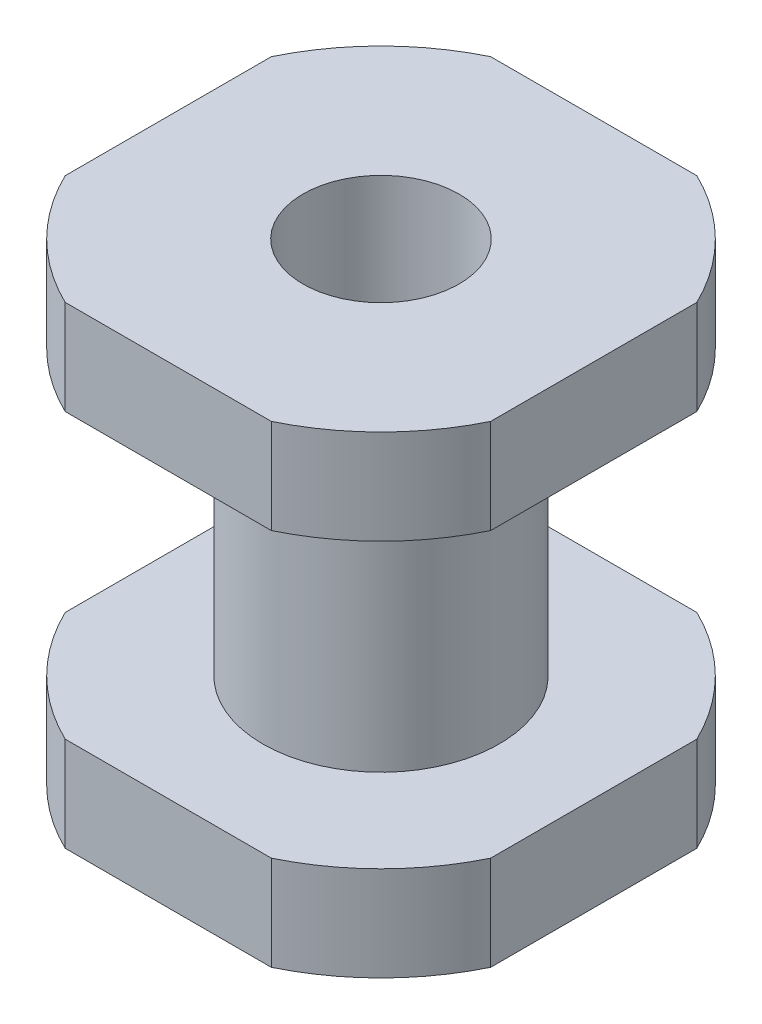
ISO-10303-21;
HEADER;
FILE_DESCRIPTION(('STEP AP214'),'2;1');
FILE_NAME('part.step','',(''),(''),'','','');
FILE_SCHEMA(('AUTOMOTIVE_DESIGN { 1 0 10303 214 1 1 1 1 }'));
ENDSEC;
DATA;
#1=APPLICATION_CONTEXT('core data for automotive mechanical design processes');
#2=APPLICATION_PROTOCOL_DEFINITION('international standard','automotive_design',2000,#1);
#3=PRODUCT_CONTEXT('',#1,'mechanical');
#4=PRODUCT('Part','Part','',(#3));
#5=PRODUCT_RELATED_PRODUCT_CATEGORY('part','',(#4));
#6=PRODUCT_DEFINITION_FORMATION('','',#4);
#7=PRODUCT_DEFINITION_CONTEXT('part definition',#1,'design');
#8=PRODUCT_DEFINITION('design','',#6,#7);
#9=PRODUCT_DEFINITION_SHAPE('','',#8);
#10=(LENGTH_UNIT() NAMED_UNIT(*) SI_UNIT(.MILLI.,.METRE.));
#11=(NAMED_UNIT(*) PLANE_ANGLE_UNIT() SI_UNIT($,.RADIAN.));
#12=(NAMED_UNIT(*) SI_UNIT($,.STERADIAN.) SOLID_ANGLE_UNIT());
#13=UNCERTAINTY_MEASURE_WITH_UNIT(LENGTH_MEASURE(1.E-05),#10,'distance_accuracy_value','');
#14=(GEOMETRIC_REPRESENTATION_CONTEXT(3) GLOBAL_UNCERTAINTY_ASSIGNED_CONTEXT((#13)) GLOBAL_UNIT_ASSIGNED_CONTEXT((#10,
#11,#12)) REPRESENTATION_CONTEXT('',''));
#15=CARTESIAN_POINT('',(0.,0.,0.));
#16=DIRECTION('',(0.,0.,1.));
#17=DIRECTION('',(1.,0.,0.));
#18=AXIS2_PLACEMENT_3D('',#15,#16,#17);
#19=CARTESIAN_POINT('',(-11.3777969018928,1.18499139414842,0.));
#20=DIRECTION('',(0.,-1.,0.));
#21=DIRECTION('',(0.,0.,-1.));
#22=AXIS2_PLACEMENT_3D('',#19,#20,#21);
#23=PLANE('',#22);
#24=CARTESIAN_POINT('',(-11.3777969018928,1.18499139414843,0.));
#25=DIRECTION('',(0.,-1.,0.));
#26=DIRECTION('',(0.,0.,-1.));
#27=AXIS2_PLACEMENT_3D('',#24,#25,#26);
#28=CIRCLE('',#27,1.65);
#29=CARTESIAN_POINT('',(-11.3777969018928,1.18499139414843,-1.65));
#30=VERTEX_POINT('',#29);
#31=EDGE_CURVE('E246',#30,#30,#28,.T.);
#32=ORIENTED_EDGE('',*,*,#31,.T.);
#33=EDGE_LOOP('',(#32));
#34=FACE_BOUND('',#33,.T.);
#35=DIRECTION('',(0.,0.,-1.));
#36=VECTOR('',#35,1.);
#37=CARTESIAN_POINT('',(-6.87779690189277,1.18499139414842,-4.5));
#38=LINE('',#37,#36);
#39=CARTESIAN_POINT('',(-6.87779690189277,1.18499139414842,2.17944947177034));
#40=VERTEX_POINT('',#39);
#41=CARTESIAN_POINT('',(-6.87779690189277,1.18499139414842,-2.17944947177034));
#42=VERTEX_POINT('',#41);
#43=EDGE_CURVE('E138',#40,#42,#38,.T.);
#44=ORIENTED_EDGE('',*,*,#43,.T.);
#45=CARTESIAN_POINT('',(-11.3777969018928,1.18499139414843,0.));
#46=DIRECTION('',(0.,1.,0.));
#47=DIRECTION('',(0.,0.,1.));
#48=AXIS2_PLACEMENT_3D('',#45,#46,#47);
#49=CIRCLE('',#48,5.);
#50=CARTESIAN_POINT('',(-9.19834743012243,1.18499139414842,-4.5));
#51=VERTEX_POINT('',#50);
#52=EDGE_CURVE('E145',#42,#51,#49,.T.);
#53=ORIENTED_EDGE('',*,*,#52,.T.);
#54=DIRECTION('',(-1.,0.,0.));
#55=VECTOR('',#54,1.);
#56=CARTESIAN_POINT('',(-15.8777969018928,1.18499139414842,-4.5));
#57=LINE('',#56,#55);
#58=CARTESIAN_POINT('',(-13.5572463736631,1.18499139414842,-4.5));
#59=VERTEX_POINT('',#58);
#60=EDGE_CURVE('E126',#51,#59,#57,.T.);
#61=ORIENTED_EDGE('',*,*,#60,.T.);
#62=CARTESIAN_POINT('',(-15.8777969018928,1.18499139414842,-2.17944947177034));
#63=VERTEX_POINT('',#62);
#64=EDGE_CURVE('E153',#59,#63,#49,.T.);
#65=ORIENTED_EDGE('',*,*,#64,.T.);
#66=DIRECTION('',(0.,0.,1.));
#67=VECTOR('',#66,1.);
#68=CARTESIAN_POINT('',(-15.8777969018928,1.18499139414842,-4.5));
#69=LINE('',#68,#67);
#70=CARTESIAN_POINT('',(-15.8777969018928,1.18499139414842,2.17944947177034));
#71=VERTEX_POINT('',#70);
#72=EDGE_CURVE('E137',#63,#71,#69,.T.);
#73=ORIENTED_EDGE('',*,*,#72,.T.);
#74=CARTESIAN_POINT('',(-13.5572463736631,1.18499139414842,4.5));
#75=VERTEX_POINT('',#74);
#76=EDGE_CURVE('E156',#71,#75,#49,.T.);
#77=ORIENTED_EDGE('',*,*,#76,.T.);
#78=DIRECTION('',(1.,0.,0.));
#79=VECTOR('',#78,1.);
#80=CARTESIAN_POINT('',(-15.8777969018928,1.18499139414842,4.5));
#81=LINE('',#80,#79);
#82=CARTESIAN_POINT('',(-9.19834743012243,1.18499139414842,4.5));
#83=VERTEX_POINT('',#82);
#84=EDGE_CURVE('E240',#75,#83,#81,.T.);
#85=ORIENTED_EDGE('',*,*,#84,.T.);
#86=EDGE_CURVE('E152',#83,#40,#49,.T.);
#87=ORIENTED_EDGE('',*,*,#86,.T.);
#88=EDGE_LOOP('',(#44,#53,#61,#65,#73,#77,#85,#87));
#89=FACE_BOUND('',#88,.T.);
#90=ADVANCED_FACE('F16',(#34,#89),#23,.F.);
#91=CARTESIAN_POINT('',(-11.3777969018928,4.31752151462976,0.));
#92=DIRECTION('',(0.,1.,0.));
#93=DIRECTION('',(0.,0.,1.));
#94=AXIS2_PLACEMENT_3D('',#91,#92,#93);
#95=CYLINDRICAL_SURFACE('',#94,5.);
#96=DIRECTION('',(0.,1.,0.));
#97=VECTOR('',#96,1.);
#98=CARTESIAN_POINT('',(-6.87779690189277,4.31752151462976,-2.17944947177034));
#99=LINE('',#98,#97);
#100=CARTESIAN_POINT('',(-6.87779690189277,-0.815008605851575,-2.17944947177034));
#101=VERTEX_POINT('',#100);
#102=EDGE_CURVE('E199',#101,#42,#99,.T.);
#103=ORIENTED_EDGE('',*,*,#102,.F.);
#104=CARTESIAN_POINT('',(-11.3777969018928,-0.815008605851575,0.));
#105=DIRECTION('',(0.,1.,0.));
#106=DIRECTION('',(0.,0.,1.));
#107=AXIS2_PLACEMENT_3D('',#104,#105,#106);
#108=CIRCLE('',#107,5.);
#109=CARTESIAN_POINT('',(-9.19834743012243,-0.815008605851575,-4.5));
#110=VERTEX_POINT('',#109);
#111=EDGE_CURVE('E147',#101,#110,#108,.T.);
#112=ORIENTED_EDGE('',*,*,#111,.T.);
#113=DIRECTION('',(0.,1.,0.));
#114=VECTOR('',#113,1.);
#115=CARTESIAN_POINT('',(-9.19834743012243,4.31752151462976,-4.5));
#116=LINE('',#115,#114);
#117=EDGE_CURVE('E129',#51,#110,#116,.F.);
#118=ORIENTED_EDGE('',*,*,#117,.F.);
#119=ORIENTED_EDGE('',*,*,#52,.F.);
#120=EDGE_LOOP('',(#103,#112,#118,#119));
#121=FACE_BOUND('',#120,.T.);
#122=ADVANCED_FACE('F144',(#121),#95,.T.);
#123=DIRECTION('',(0.,1.,0.));
#124=VECTOR('',#123,1.);
#125=CARTESIAN_POINT('',(-6.87779690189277,4.31752151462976,2.17944947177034));
#126=LINE('',#125,#124);
#127=CARTESIAN_POINT('',(-6.87779690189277,-0.815008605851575,2.17944947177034));
#128=VERTEX_POINT('',#127);
#129=EDGE_CURVE('E203',#40,#128,#126,.F.);
#130=ORIENTED_EDGE('',*,*,#129,.F.);
#131=ORIENTED_EDGE('',*,*,#86,.F.);
#132=DIRECTION('',(0.,1.,0.));
#133=VECTOR('',#132,1.);
#134=CARTESIAN_POINT('',(-9.19834743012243,4.31752151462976,4.5));
#135=LINE('',#134,#133);
#136=CARTESIAN_POINT('',(-9.19834743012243,-0.815008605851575,4.5));
#137=VERTEX_POINT('',#136);
#138=EDGE_CURVE('E215',#137,#83,#135,.T.);
#139=ORIENTED_EDGE('',*,*,#138,.F.);
#140=EDGE_CURVE('E159',#137,#128,#108,.T.);
#141=ORIENTED_EDGE('',*,*,#140,.T.);
#142=EDGE_LOOP('',(#130,#131,#139,#141));
#143=FACE_BOUND('',#142,.T.);
#144=ADVANCED_FACE('F279',(#143),#95,.T.);
#145=DIRECTION('',(0.,1.,0.));
#146=VECTOR('',#145,1.);
#147=CARTESIAN_POINT('',(-13.5572463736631,4.31752151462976,4.5));
#148=LINE('',#147,#146);
#149=CARTESIAN_POINT('',(-13.5572463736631,-0.815008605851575,4.5));
#150=VERTEX_POINT('',#149);
#151=EDGE_CURVE('E30',#75,#150,#148,.F.);
#152=ORIENTED_EDGE('',*,*,#151,.F.);
#153=ORIENTED_EDGE('',*,*,#76,.F.);
#154=DIRECTION('',(0.,1.,0.));
#155=VECTOR('',#154,1.);
#156=CARTESIAN_POINT('',(-15.8777969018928,4.31752151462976,2.17944947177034));
#157=LINE('',#156,#155);
#158=CARTESIAN_POINT('',(-15.8777969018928,-0.815008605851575,2.17944947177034));
#159=VERTEX_POINT('',#158);
#160=EDGE_CURVE('E221',#159,#71,#157,.T.);
#161=ORIENTED_EDGE('',*,*,#160,.F.);
#162=EDGE_CURVE('E332',#159,#150,#108,.T.);
#163=ORIENTED_EDGE('',*,*,#162,.T.);
#164=EDGE_LOOP('',(#152,#153,#161,#163));
#165=FACE_BOUND('',#164,.T.);
#166=ADVANCED_FACE('F349',(#165),#95,.T.);
#167=DIRECTION('',(0.,1.,0.));
#168=VECTOR('',#167,1.);
#169=CARTESIAN_POINT('',(-15.8777969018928,4.31752151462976,-2.17944947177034));
#170=LINE('',#169,#168);
#171=CARTESIAN_POINT('',(-15.8777969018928,-0.815008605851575,-2.17944947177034));
#172=VERTEX_POINT('',#171);
#173=EDGE_CURVE('E38',#63,#172,#170,.F.);
#174=ORIENTED_EDGE('',*,*,#173,.F.);
#175=ORIENTED_EDGE('',*,*,#64,.F.);
#176=DIRECTION('',(0.,1.,0.));
#177=VECTOR('',#176,1.);
#178=CARTESIAN_POINT('',(-13.5572463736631,4.31752151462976,-4.5));
#179=LINE('',#178,#177);
#180=CARTESIAN_POINT('',(-13.5572463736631,-0.815008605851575,-4.5));
#181=VERTEX_POINT('',#180);
#182=EDGE_CURVE('E132',#181,#59,#179,.T.);
#183=ORIENTED_EDGE('',*,*,#182,.F.);
#184=EDGE_CURVE('E336',#181,#172,#108,.T.);
#185=ORIENTED_EDGE('',*,*,#184,.T.);
#186=EDGE_LOOP('',(#174,#175,#183,#185));
#187=FACE_BOUND('',#186,.T.);
#188=ADVANCED_FACE('F280',(#187),#95,.T.);
#189=CARTESIAN_POINT('',(-6.37779690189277,-0.815008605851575,0.));
#190=DIRECTION('',(0.,1.,0.));
#191=DIRECTION('',(0.,0.,1.));
#192=AXIS2_PLACEMENT_3D('',#189,#190,#191);
#193=PLANE('',#192);
#194=CARTESIAN_POINT('',(-11.3777969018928,-0.815008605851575,0.));
#195=DIRECTION('',(0.,1.,0.));
#196=DIRECTION('',(0.,0.,1.));
#197=AXIS2_PLACEMENT_3D('',#194,#195,#196);
#198=CIRCLE('',#197,2.5);
#199=CARTESIAN_POINT('',(-11.3777969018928,-0.815008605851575,2.5));
#200=VERTEX_POINT('',#199);
#201=EDGE_CURVE('E330',#200,#200,#198,.T.);
#202=ORIENTED_EDGE('',*,*,#201,.T.);
#203=EDGE_LOOP('',(#202));
#204=FACE_BOUND('',#203,.T.);
#205=DIRECTION('',(0.,0.,-1.));
#206=VECTOR('',#205,1.);
#207=CARTESIAN_POINT('',(-6.87779690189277,-0.815008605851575,0.));
#208=LINE('',#207,#206);
#209=EDGE_CURVE('E205',#128,#101,#208,.T.);
#210=ORIENTED_EDGE('',*,*,#209,.F.);
#211=ORIENTED_EDGE('',*,*,#140,.F.);
#212=DIRECTION('',(1.,0.,0.));
#213=VECTOR('',#212,1.);
#214=CARTESIAN_POINT('',(-6.37779690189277,-0.815008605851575,4.5));
#215=LINE('',#214,#213);
#216=EDGE_CURVE('E183',#150,#137,#215,.T.);
#217=ORIENTED_EDGE('',*,*,#216,.F.);
#218=ORIENTED_EDGE('',*,*,#162,.F.);
#219=DIRECTION('',(0.,0.,1.));
#220=VECTOR('',#219,1.);
#221=CARTESIAN_POINT('',(-15.8777969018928,-0.815008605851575,0.));
#222=LINE('',#221,#220);
#223=EDGE_CURVE('E224',#172,#159,#222,.T.);
#224=ORIENTED_EDGE('',*,*,#223,.F.);
#225=ORIENTED_EDGE('',*,*,#184,.F.);
#226=DIRECTION('',(-1.,0.,0.));
#227=VECTOR('',#226,1.);
#228=CARTESIAN_POINT('',(-6.37779690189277,-0.815008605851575,-4.5));
#229=LINE('',#228,#227);
#230=EDGE_CURVE('E148',#110,#181,#229,.T.);
#231=ORIENTED_EDGE('',*,*,#230,.F.);
#232=ORIENTED_EDGE('',*,*,#111,.F.);
#233=EDGE_LOOP('',(#210,#211,#217,#218,#224,#225,#231,#232));
#234=FACE_BOUND('',#233,.T.);
#235=ADVANCED_FACE('F352',(#204,#234),#193,.F.);
#236=CARTESIAN_POINT('',(-8.87779690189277,-6.81500860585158,0.));
#237=DIRECTION('',(0.,-1.,0.));
#238=DIRECTION('',(0.,0.,-1.));
#239=AXIS2_PLACEMENT_3D('',#236,#237,#238);
#240=PLANE('',#239);
#241=CARTESIAN_POINT('',(-11.3777969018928,-6.81500860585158,0.));
#242=DIRECTION('',(0.,1.,0.));
#243=DIRECTION('',(0.,0.,1.));
#244=AXIS2_PLACEMENT_3D('',#241,#242,#243);
#245=CIRCLE('',#244,2.5);
#246=CARTESIAN_POINT('',(-11.3777969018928,-6.81500860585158,2.5));
#247=VERTEX_POINT('',#246);
#248=EDGE_CURVE('E328',#247,#247,#245,.T.);
#249=ORIENTED_EDGE('',*,*,#248,.F.);
#250=EDGE_LOOP('',(#249));
#251=FACE_BOUND('',#250,.T.);
#252=DIRECTION('',(0.,0.,1.));
#253=VECTOR('',#252,1.);
#254=CARTESIAN_POINT('',(-6.87779690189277,-6.81500860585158,0.));
#255=LINE('',#254,#253);
#256=CARTESIAN_POINT('',(-6.87779690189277,-6.81500860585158,-2.17944947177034));
#257=VERTEX_POINT('',#256);
#258=CARTESIAN_POINT('',(-6.87779690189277,-6.81500860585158,2.17944947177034));
#259=VERTEX_POINT('',#258);
#260=EDGE_CURVE('E211',#257,#259,#255,.T.);
#261=ORIENTED_EDGE('',*,*,#260,.F.);
#262=CARTESIAN_POINT('',(-11.3777969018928,-6.81500860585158,0.));
#263=DIRECTION('',(0.,1.,0.));
#264=DIRECTION('',(0.,0.,1.));
#265=AXIS2_PLACEMENT_3D('',#262,#263,#264);
#266=CIRCLE('',#265,5.);
#267=CARTESIAN_POINT('',(-9.19834743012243,-6.81500860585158,-4.5));
#268=VERTEX_POINT('',#267);
#269=EDGE_CURVE('E325',#257,#268,#266,.T.);
#270=ORIENTED_EDGE('',*,*,#269,.T.);
#271=DIRECTION('',(1.,0.,0.));
#272=VECTOR('',#271,1.);
#273=CARTESIAN_POINT('',(-8.87779690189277,-6.81500860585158,-4.5));
#274=LINE('',#273,#272);
#275=CARTESIAN_POINT('',(-13.5572463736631,-6.81500860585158,-4.5));
#276=VERTEX_POINT('',#275);
#277=EDGE_CURVE('E236',#276,#268,#274,.T.);
#278=ORIENTED_EDGE('',*,*,#277,.F.);
#279=CARTESIAN_POINT('',(-15.8777969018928,-6.81500860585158,-2.17944947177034));
#280=VERTEX_POINT('',#279);
#281=EDGE_CURVE('E194',#276,#280,#266,.T.);
#282=ORIENTED_EDGE('',*,*,#281,.T.);
#283=DIRECTION('',(0.,0.,-1.));
#284=VECTOR('',#283,1.);
#285=CARTESIAN_POINT('',(-15.8777969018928,-6.81500860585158,0.));
#286=LINE('',#285,#284);
#287=CARTESIAN_POINT('',(-15.8777969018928,-6.81500860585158,2.17944947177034));
#288=VERTEX_POINT('',#287);
#289=EDGE_CURVE('E228',#288,#280,#286,.T.);
#290=ORIENTED_EDGE('',*,*,#289,.F.);
#291=CARTESIAN_POINT('',(-13.5572463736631,-6.81500860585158,4.5));
#292=VERTEX_POINT('',#291);
#293=EDGE_CURVE('E189',#288,#292,#266,.T.);
#294=ORIENTED_EDGE('',*,*,#293,.T.);
#295=DIRECTION('',(-1.,0.,0.));
#296=VECTOR('',#295,1.);
#297=CARTESIAN_POINT('',(-8.87779690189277,-6.81500860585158,4.5));
#298=LINE('',#297,#296);
#299=CARTESIAN_POINT('',(-9.19834743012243,-6.81500860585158,4.5));
#300=VERTEX_POINT('',#299);
#301=EDGE_CURVE('E184',#300,#292,#298,.T.);
#302=ORIENTED_EDGE('',*,*,#301,.F.);
#303=EDGE_CURVE('E182',#300,#259,#266,.T.);
#304=ORIENTED_EDGE('',*,*,#303,.T.);
#305=EDGE_LOOP('',(#261,#270,#278,#282,#290,#294,#302,#304));
#306=FACE_BOUND('',#305,.T.);
#307=ADVANCED_FACE('F322',(#251,#306),#240,.F.);
#308=CARTESIAN_POINT('',(-11.3777969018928,4.31752151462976,0.));
#309=DIRECTION('',(0.,1.,0.));
#310=DIRECTION('',(0.,0.,1.));
#311=AXIS2_PLACEMENT_3D('',#308,#309,#310);
#312=CYLINDRICAL_SURFACE('',#311,5.);
#313=DIRECTION('',(0.,1.,0.));
#314=VECTOR('',#313,1.);
#315=CARTESIAN_POINT('',(-6.87779690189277,4.31752151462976,-2.17944947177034));
#316=LINE('',#315,#314);
#317=CARTESIAN_POINT('',(-6.87779690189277,-8.81500860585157,-2.17944947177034));
#318=VERTEX_POINT('',#317);
#319=EDGE_CURVE('E209',#318,#257,#316,.T.);
#320=ORIENTED_EDGE('',*,*,#319,.F.);
#321=CARTESIAN_POINT('',(-11.3777969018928,-8.81500860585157,0.));
#322=DIRECTION('',(0.,1.,0.));
#323=DIRECTION('',(0.,0.,1.));
#324=AXIS2_PLACEMENT_3D('',#321,#322,#323);
#325=CIRCLE('',#324,5.);
#326=CARTESIAN_POINT('',(-9.19834743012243,-8.81500860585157,-4.5));
#327=VERTEX_POINT('',#326);
#328=EDGE_CURVE('E190',#318,#327,#325,.T.);
#329=ORIENTED_EDGE('',*,*,#328,.T.);
#330=DIRECTION('',(0.,1.,0.));
#331=VECTOR('',#330,1.);
#332=CARTESIAN_POINT('',(-9.19834743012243,4.31752151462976,-4.5));
#333=LINE('',#332,#331);
#334=EDGE_CURVE('E238',#268,#327,#333,.F.);
#335=ORIENTED_EDGE('',*,*,#334,.F.);
#336=ORIENTED_EDGE('',*,*,#269,.F.);
#337=EDGE_LOOP('',(#320,#329,#335,#336));
#338=FACE_BOUND('',#337,.T.);
#339=ADVANCED_FACE('F271',(#338),#312,.T.);
#340=DIRECTION('',(0.,1.,0.));
#341=VECTOR('',#340,1.);
#342=CARTESIAN_POINT('',(-6.87779690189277,4.31752151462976,2.17944947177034));
#343=LINE('',#342,#341);
#344=CARTESIAN_POINT('',(-6.87779690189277,-8.81500860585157,2.17944947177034));
#345=VERTEX_POINT('',#344);
#346=EDGE_CURVE('E213',#259,#345,#343,.F.);
#347=ORIENTED_EDGE('',*,*,#346,.F.);
#348=ORIENTED_EDGE('',*,*,#303,.F.);
#349=DIRECTION('',(0.,1.,0.));
#350=VECTOR('',#349,1.);
#351=CARTESIAN_POINT('',(-9.19834743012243,4.31752151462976,4.5));
#352=LINE('',#351,#350);
#353=CARTESIAN_POINT('',(-9.19834743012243,-8.81500860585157,4.5));
#354=VERTEX_POINT('',#353);
#355=EDGE_CURVE('E167',#354,#300,#352,.T.);
#356=ORIENTED_EDGE('',*,*,#355,.F.);
#357=EDGE_CURVE('E180',#354,#345,#325,.T.);
#358=ORIENTED_EDGE('',*,*,#357,.T.);
#359=EDGE_LOOP('',(#347,#348,#356,#358));
#360=FACE_BOUND('',#359,.T.);
#361=ADVANCED_FACE('F179',(#360),#312,.T.);
#362=DIRECTION('',(0.,1.,0.));
#363=VECTOR('',#362,1.);
#364=CARTESIAN_POINT('',(-13.5572463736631,4.31752151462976,4.5));
#365=LINE('',#364,#363);
#366=CARTESIAN_POINT('',(-13.5572463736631,-8.81500860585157,4.5));
#367=VERTEX_POINT('',#366);
#368=EDGE_CURVE('E170',#292,#367,#365,.F.);
#369=ORIENTED_EDGE('',*,*,#368,.F.);
#370=ORIENTED_EDGE('',*,*,#293,.F.);
#371=DIRECTION('',(0.,1.,0.));
#372=VECTOR('',#371,1.);
#373=CARTESIAN_POINT('',(-15.8777969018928,4.31752151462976,2.17944947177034));
#374=LINE('',#373,#372);
#375=CARTESIAN_POINT('',(-15.8777969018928,-8.81500860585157,2.17944947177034));
#376=VERTEX_POINT('',#375);
#377=EDGE_CURVE('E226',#376,#288,#374,.T.);
#378=ORIENTED_EDGE('',*,*,#377,.F.);
#379=EDGE_CURVE('E192',#376,#367,#325,.T.);
#380=ORIENTED_EDGE('',*,*,#379,.T.);
#381=EDGE_LOOP('',(#369,#370,#378,#380));
#382=FACE_BOUND('',#381,.T.);
#383=ADVANCED_FACE('F268',(#382),#312,.T.);
#384=DIRECTION('',(0.,1.,0.));
#385=VECTOR('',#384,1.);
#386=CARTESIAN_POINT('',(-15.8777969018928,4.31752151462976,-2.17944947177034));
#387=LINE('',#386,#385);
#388=CARTESIAN_POINT('',(-15.8777969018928,-8.81500860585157,-2.17944947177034));
#389=VERTEX_POINT('',#388);
#390=EDGE_CURVE('E230',#280,#389,#387,.F.);
#391=ORIENTED_EDGE('',*,*,#390,.F.);
#392=ORIENTED_EDGE('',*,*,#281,.F.);
#393=DIRECTION('',(0.,1.,0.));
#394=VECTOR('',#393,1.);
#395=CARTESIAN_POINT('',(-13.5572463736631,4.31752151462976,-4.5));
#396=LINE('',#395,#394);
#397=CARTESIAN_POINT('',(-13.5572463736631,-8.81500860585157,-4.5));
#398=VERTEX_POINT('',#397);
#399=EDGE_CURVE('E234',#398,#276,#396,.T.);
#400=ORIENTED_EDGE('',*,*,#399,.F.);
#401=EDGE_CURVE('E197',#398,#389,#325,.T.);
#402=ORIENTED_EDGE('',*,*,#401,.T.);
#403=EDGE_LOOP('',(#391,#392,#400,#402));
#404=FACE_BOUND('',#403,.T.);
#405=ADVANCED_FACE('F257',(#404),#312,.T.);
#406=CARTESIAN_POINT('',(-6.37779690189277,-8.81500860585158,0.));
#407=DIRECTION('',(0.,1.,0.));
#408=DIRECTION('',(0.,0.,1.));
#409=AXIS2_PLACEMENT_3D('',#406,#407,#408);
#410=PLANE('',#409);
#411=CARTESIAN_POINT('',(-11.3777969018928,-8.81500860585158,0.));
#412=DIRECTION('',(0.,-1.,0.));
#413=DIRECTION('',(0.,0.,-1.));
#414=AXIS2_PLACEMENT_3D('',#411,#412,#413);
#415=CIRCLE('',#414,1.65);
#416=CARTESIAN_POINT('',(-11.3777969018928,-8.81500860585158,-1.65));
#417=VERTEX_POINT('',#416);
#418=EDGE_CURVE('E249',#417,#417,#415,.T.);
#419=ORIENTED_EDGE('',*,*,#418,.F.);
#420=EDGE_LOOP('',(#419));
#421=FACE_BOUND('',#420,.T.);
#422=DIRECTION('',(0.,0.,-1.));
#423=VECTOR('',#422,1.);
#424=CARTESIAN_POINT('',(-6.87779690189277,-8.81500860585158,0.));
#425=LINE('',#424,#423);
#426=EDGE_CURVE('E11',#345,#318,#425,.T.);
#427=ORIENTED_EDGE('',*,*,#426,.F.);
#428=ORIENTED_EDGE('',*,*,#357,.F.);
#429=DIRECTION('',(1.,0.,0.));
#430=VECTOR('',#429,1.);
#431=CARTESIAN_POINT('',(-6.37779690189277,-8.81500860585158,4.5));
#432=LINE('',#431,#430);
#433=EDGE_CURVE('E23',#367,#354,#432,.T.);
#434=ORIENTED_EDGE('',*,*,#433,.F.);
#435=ORIENTED_EDGE('',*,*,#379,.F.);
#436=DIRECTION('',(0.,0.,1.));
#437=VECTOR('',#436,1.);
#438=CARTESIAN_POINT('',(-15.8777969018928,-8.81500860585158,0.));
#439=LINE('',#438,#437);
#440=EDGE_CURVE('E162',#389,#376,#439,.T.);
#441=ORIENTED_EDGE('',*,*,#440,.F.);
#442=ORIENTED_EDGE('',*,*,#401,.F.);
#443=DIRECTION('',(-1.,0.,0.));
#444=VECTOR('',#443,1.);
#445=CARTESIAN_POINT('',(-6.37779690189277,-8.81500860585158,-4.5));
#446=LINE('',#445,#444);
#447=EDGE_CURVE('E155',#327,#398,#446,.T.);
#448=ORIENTED_EDGE('',*,*,#447,.F.);
#449=ORIENTED_EDGE('',*,*,#328,.F.);
#450=EDGE_LOOP('',(#427,#428,#434,#435,#441,#442,#448,#449));
#451=FACE_BOUND('',#450,.T.);
#452=ADVANCED_FACE('F187',(#421,#451),#410,.F.);
#453=CARTESIAN_POINT('',(-11.3777969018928,4.31752151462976,0.));
#454=DIRECTION('',(0.,1.,0.));
#455=DIRECTION('',(0.,0.,1.));
#456=AXIS2_PLACEMENT_3D('',#453,#454,#455);
#457=CYLINDRICAL_SURFACE('',#456,2.5);
#458=ORIENTED_EDGE('',*,*,#201,.F.);
#459=EDGE_LOOP('',(#458));
#460=FACE_BOUND('',#459,.T.);
#461=ORIENTED_EDGE('',*,*,#248,.T.);
#462=EDGE_LOOP('',(#461));
#463=FACE_BOUND('',#462,.T.);
#464=ADVANCED_FACE('F256',(#460,#463),#457,.T.);
#465=CARTESIAN_POINT('',(-15.8777969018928,-8.81500860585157,-4.5));
#466=DIRECTION('',(0.,0.,-1.));
#467=DIRECTION('',(-1.,0.,0.));
#468=AXIS2_PLACEMENT_3D('',#465,#466,#467);
#469=PLANE('',#468);
#470=ORIENTED_EDGE('',*,*,#399,.T.);
#471=ORIENTED_EDGE('',*,*,#277,.T.);
#472=ORIENTED_EDGE('',*,*,#334,.T.);
#473=ORIENTED_EDGE('',*,*,#447,.T.);
#474=EDGE_LOOP('',(#470,#471,#472,#473));
#475=FACE_BOUND('',#474,.T.);
#476=ADVANCED_FACE('F265',(#475),#469,.T.);
#477=CARTESIAN_POINT('',(-15.8777969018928,-8.81500860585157,-4.5));
#478=DIRECTION('',(-1.,0.,0.));
#479=DIRECTION('',(0.,0.,1.));
#480=AXIS2_PLACEMENT_3D('',#477,#478,#479);
#481=PLANE('',#480);
#482=ORIENTED_EDGE('',*,*,#377,.T.);
#483=ORIENTED_EDGE('',*,*,#289,.T.);
#484=ORIENTED_EDGE('',*,*,#390,.T.);
#485=ORIENTED_EDGE('',*,*,#440,.T.);
#486=EDGE_LOOP('',(#482,#483,#484,#485));
#487=FACE_BOUND('',#486,.T.);
#488=ADVANCED_FACE('F298',(#487),#481,.T.);
#489=CARTESIAN_POINT('',(-15.8777969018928,-8.81500860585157,4.5));
#490=DIRECTION('',(0.,0.,1.));
#491=DIRECTION('',(1.,0.,0.));
#492=AXIS2_PLACEMENT_3D('',#489,#490,#491);
#493=PLANE('',#492);
#494=ORIENTED_EDGE('',*,*,#355,.T.);
#495=ORIENTED_EDGE('',*,*,#301,.T.);
#496=ORIENTED_EDGE('',*,*,#368,.T.);
#497=ORIENTED_EDGE('',*,*,#433,.T.);
#498=EDGE_LOOP('',(#494,#495,#496,#497));
#499=FACE_BOUND('',#498,.T.);
#500=ADVANCED_FACE('F166',(#499),#493,.T.);
#501=CARTESIAN_POINT('',(-6.87779690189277,-8.81500860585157,-4.5));
#502=DIRECTION('',(1.,0.,0.));
#503=DIRECTION('',(0.,0.,-1.));
#504=AXIS2_PLACEMENT_3D('',#501,#502,#503);
#505=PLANE('',#504);
#506=ORIENTED_EDGE('',*,*,#319,.T.);
#507=ORIENTED_EDGE('',*,*,#260,.T.);
#508=ORIENTED_EDGE('',*,*,#346,.T.);
#509=ORIENTED_EDGE('',*,*,#426,.T.);
#510=EDGE_LOOP('',(#506,#507,#508,#509));
#511=FACE_BOUND('',#510,.T.);
#512=ADVANCED_FACE('F291',(#511),#505,.T.);
#513=ORIENTED_EDGE('',*,*,#182,.T.);
#514=ORIENTED_EDGE('',*,*,#60,.F.);
#515=ORIENTED_EDGE('',*,*,#117,.T.);
#516=ORIENTED_EDGE('',*,*,#230,.T.);
#517=EDGE_LOOP('',(#513,#514,#515,#516));
#518=FACE_BOUND('',#517,.T.);
#519=ADVANCED_FACE('F128',(#518),#469,.T.);
#520=ORIENTED_EDGE('',*,*,#160,.T.);
#521=ORIENTED_EDGE('',*,*,#72,.F.);
#522=ORIENTED_EDGE('',*,*,#173,.T.);
#523=ORIENTED_EDGE('',*,*,#223,.T.);
#524=EDGE_LOOP('',(#520,#521,#522,#523));
#525=FACE_BOUND('',#524,.T.);
#526=ADVANCED_FACE('F295',(#525),#481,.T.);
#527=ORIENTED_EDGE('',*,*,#138,.T.);
#528=ORIENTED_EDGE('',*,*,#84,.F.);
#529=ORIENTED_EDGE('',*,*,#151,.T.);
#530=ORIENTED_EDGE('',*,*,#216,.T.);
#531=EDGE_LOOP('',(#527,#528,#529,#530));
#532=FACE_BOUND('',#531,.T.);
#533=ADVANCED_FACE('F290',(#532),#493,.T.);
#534=ORIENTED_EDGE('',*,*,#102,.T.);
#535=ORIENTED_EDGE('',*,*,#43,.F.);
#536=ORIENTED_EDGE('',*,*,#129,.T.);
#537=ORIENTED_EDGE('',*,*,#209,.T.);
#538=EDGE_LOOP('',(#534,#535,#536,#537));
#539=FACE_BOUND('',#538,.T.);
#540=ADVANCED_FACE('F284',(#539),#505,.T.);
#541=CARTESIAN_POINT('',(-11.3777969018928,-8.81500860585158,0.));
#542=DIRECTION('',(0.,-1.,0.));
#543=DIRECTION('',(0.,0.,-1.));
#544=AXIS2_PLACEMENT_3D('',#541,#542,#543);
#545=CYLINDRICAL_SURFACE('',#544,1.65);
#546=ORIENTED_EDGE('',*,*,#31,.F.);
#547=EDGE_LOOP('',(#546));
#548=FACE_BOUND('',#547,.T.);
#549=ORIENTED_EDGE('',*,*,#418,.T.);
#550=EDGE_LOOP('',(#549));
#551=FACE_BOUND('',#550,.T.);
#552=ADVANCED_FACE('F253',(#548,#551),#545,.F.);
#553=CLOSED_SHELL('',(#90,#122,#144,#166,#188,#235,#307,#339,#361,#383,#405,#452,#464,#476,#488,
#500,#512,#519,#526,#533,#540,#552));
#554=MANIFOLD_SOLID_BREP('B1',#553);
#555=ADVANCED_BREP_SHAPE_REPRESENTATION('',(#18,#554),#14);
#556=SHAPE_DEFINITION_REPRESENTATION(#9,#555);
ENDSEC;
END-ISO-10303-21;
